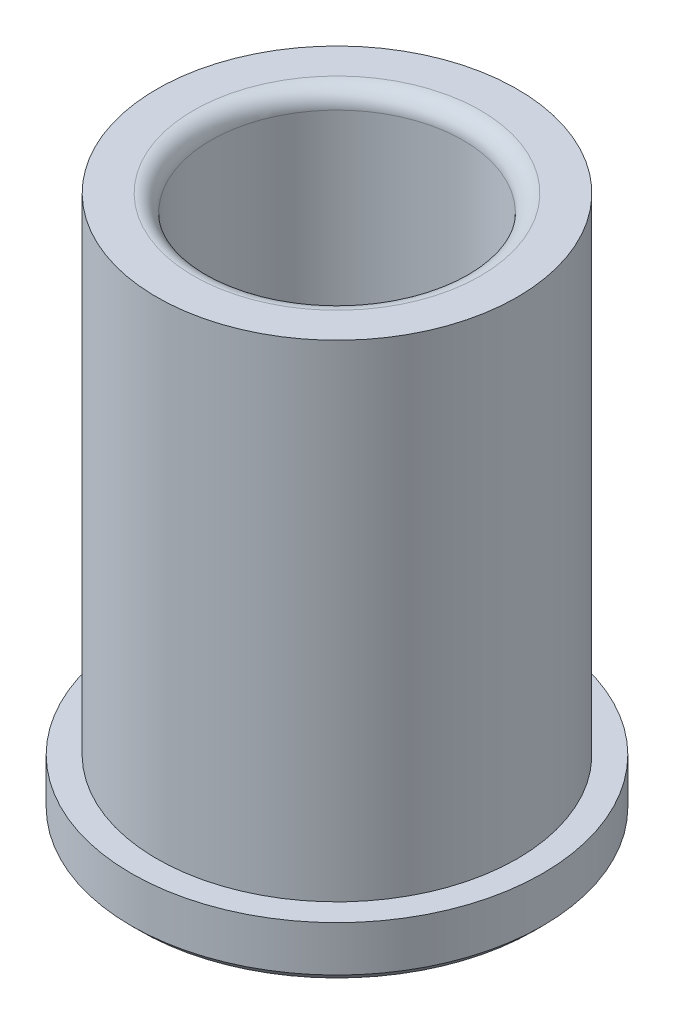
from build123d import *

# Parameters (mm, degrees)
FILLET1_R = 1.524


with BuildPart() as part:
    # Sketch1 → Revolve1 (revolve)
    with BuildSketch(Plane.XY, mode=Mode.PRIVATE) as revolve1_sk:
        Polygon((-17.3609, 0), (-18.1229, 0.762), (-18.1229, 4.7625), (-15.88135, 4.7625), (-15.88135, 47.625), (-11.11885, 47.625), (-11.11885, 0.762), (-11.88085, 0), align=None)
    revolve(revolve1_sk.sketch.rotate(Axis((0, -1000, 0), (0, 1, 0)), 180), axis=Axis((0, -1000, 0), (0, 1, 0)))

    # Fillet1
    fillet1_edges = [part.edges().sort_by_distance(p)[0] for p in [
        (-11.11885, 47.625, 0),
    ]]
    fillet(fillet1_edges, radius=FILLET1_R)


solid = part.part
